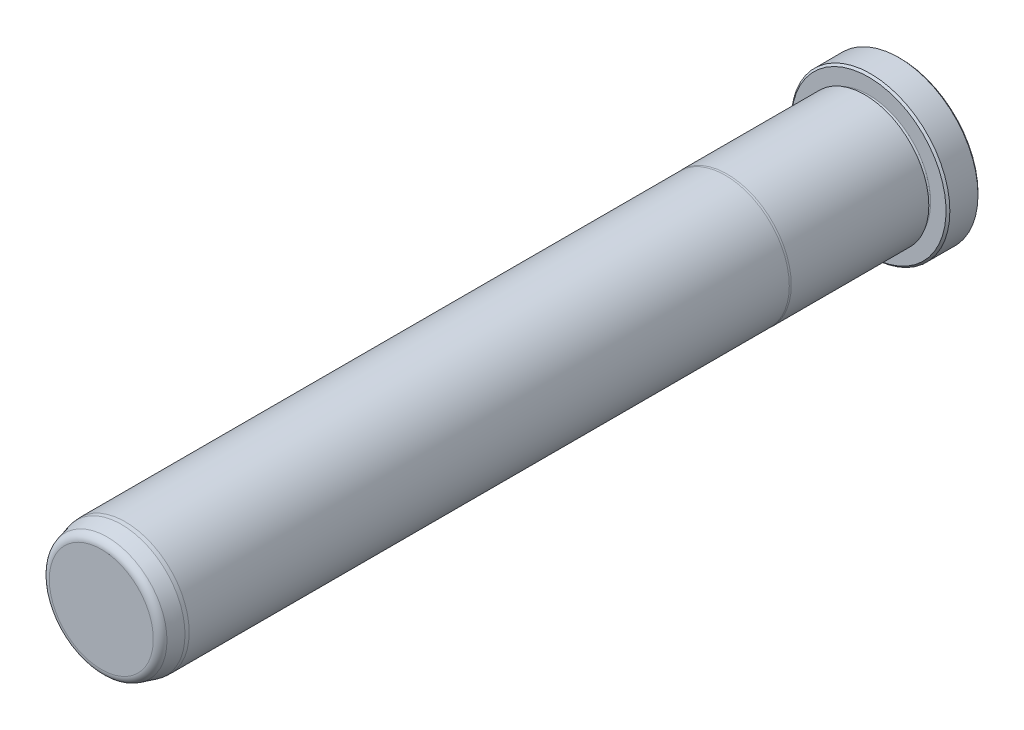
ISO-10303-21;
HEADER;
FILE_DESCRIPTION(('STEP AP214'),'2;1');
FILE_NAME('part.step','',(''),(''),'','','');
FILE_SCHEMA(('AUTOMOTIVE_DESIGN { 1 0 10303 214 1 1 1 1 }'));
ENDSEC;
DATA;
#1=APPLICATION_CONTEXT('core data for automotive mechanical design processes');
#2=APPLICATION_PROTOCOL_DEFINITION('international standard','automotive_design',2000,#1);
#3=PRODUCT_CONTEXT('',#1,'mechanical');
#4=PRODUCT('Part','Part','',(#3));
#5=PRODUCT_RELATED_PRODUCT_CATEGORY('part','',(#4));
#6=PRODUCT_DEFINITION_FORMATION('','',#4);
#7=PRODUCT_DEFINITION_CONTEXT('part definition',#1,'design');
#8=PRODUCT_DEFINITION('design','',#6,#7);
#9=PRODUCT_DEFINITION_SHAPE('','',#8);
#10=(LENGTH_UNIT() NAMED_UNIT(*) SI_UNIT(.MILLI.,.METRE.));
#11=(NAMED_UNIT(*) PLANE_ANGLE_UNIT() SI_UNIT($,.RADIAN.));
#12=(NAMED_UNIT(*) SI_UNIT($,.STERADIAN.) SOLID_ANGLE_UNIT());
#13=UNCERTAINTY_MEASURE_WITH_UNIT(LENGTH_MEASURE(1.E-05),#10,'distance_accuracy_value','');
#14=(GEOMETRIC_REPRESENTATION_CONTEXT(3) GLOBAL_UNCERTAINTY_ASSIGNED_CONTEXT((#13)) GLOBAL_UNIT_ASSIGNED_CONTEXT((#10,
#11,#12)) REPRESENTATION_CONTEXT('',''));
#15=CARTESIAN_POINT('',(0.,0.,0.));
#16=DIRECTION('',(0.,0.,1.));
#17=DIRECTION('',(1.,0.,0.));
#18=AXIS2_PLACEMENT_3D('',#15,#16,#17);
#19=CARTESIAN_POINT('',(0.,0.,0.));
#20=DIRECTION('',(0.,0.,1.));
#21=DIRECTION('',(1.,0.,0.));
#22=AXIS2_PLACEMENT_3D('',#19,#20,#21);
#23=PLANE('',#22);
#24=CARTESIAN_POINT('',(0.,0.,0.));
#25=DIRECTION('',(0.,0.,1.));
#26=DIRECTION('',(1.,0.,0.));
#27=AXIS2_PLACEMENT_3D('',#24,#25,#26);
#28=CIRCLE('',#27,15.367);
#29=CARTESIAN_POINT('',(15.367,0.,0.));
#30=VERTEX_POINT('',#29);
#31=EDGE_CURVE('E37',#30,#30,#28,.F.);
#32=ORIENTED_EDGE('',*,*,#31,.T.);
#33=EDGE_LOOP('',(#32));
#34=FACE_BOUND('',#33,.T.);
#35=ADVANCED_FACE('F30',(#34),#23,.F.);
#36=CARTESIAN_POINT('',(0.,0.,0.));
#37=DIRECTION('',(0.,0.,1.));
#38=DIRECTION('',(1.,0.,0.));
#39=AXIS2_PLACEMENT_3D('',#36,#37,#38);
#40=CYLINDRICAL_SURFACE('',#39,15.748);
#41=CARTESIAN_POINT('',(0.,0.,0.380999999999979));
#42=DIRECTION('',(0.,0.,1.));
#43=DIRECTION('',(1.,0.,0.));
#44=AXIS2_PLACEMENT_3D('',#41,#42,#43);
#45=CIRCLE('',#44,15.748);
#46=CARTESIAN_POINT('',(15.748,0.,0.380999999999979));
#47=VERTEX_POINT('',#46);
#48=EDGE_CURVE('E41',#47,#47,#45,.T.);
#49=ORIENTED_EDGE('',*,*,#48,.T.);
#50=EDGE_LOOP('',(#49));
#51=FACE_BOUND('',#50,.T.);
#52=CARTESIAN_POINT('',(0.,0.,5.96899999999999));
#53=DIRECTION('',(0.,0.,-1.));
#54=DIRECTION('',(-1.,0.,0.));
#55=AXIS2_PLACEMENT_3D('',#52,#53,#54);
#56=CIRCLE('',#55,15.748);
#57=CARTESIAN_POINT('',(-15.748,0.,5.96899999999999));
#58=VERTEX_POINT('',#57);
#59=EDGE_CURVE('E45',#58,#58,#56,.T.);
#60=ORIENTED_EDGE('',*,*,#59,.T.);
#61=EDGE_LOOP('',(#60));
#62=FACE_BOUND('',#61,.T.);
#63=ADVANCED_FACE('F118',(#51,#62),#40,.T.);
#64=CARTESIAN_POINT('',(0.,15.748,6.35));
#65=DIRECTION('',(0.,0.,-1.));
#66=DIRECTION('',(-1.,0.,0.));
#67=AXIS2_PLACEMENT_3D('',#64,#65,#66);
#68=PLANE('',#67);
#69=CARTESIAN_POINT('',(0.,0.,6.35));
#70=DIRECTION('',(0.,0.,-1.));
#71=DIRECTION('',(-1.,0.,0.));
#72=AXIS2_PLACEMENT_3D('',#69,#70,#71);
#73=CIRCLE('',#72,15.367);
#74=CARTESIAN_POINT('',(-15.367,0.,6.35));
#75=VERTEX_POINT('',#74);
#76=EDGE_CURVE('E10',#75,#75,#73,.F.);
#77=ORIENTED_EDGE('',*,*,#76,.T.);
#78=EDGE_LOOP('',(#77));
#79=FACE_BOUND('',#78,.T.);
#80=CARTESIAN_POINT('',(0.,0.,6.35));
#81=DIRECTION('',(0.,0.,1.));
#82=DIRECTION('',(1.,0.,0.));
#83=AXIS2_PLACEMENT_3D('',#80,#81,#82);
#84=CIRCLE('',#83,12.3063);
#85=CARTESIAN_POINT('',(12.3063,0.,6.35));
#86=VERTEX_POINT('',#85);
#87=EDGE_CURVE('E56',#86,#86,#84,.T.);
#88=ORIENTED_EDGE('',*,*,#87,.F.);
#89=EDGE_LOOP('',(#88));
#90=FACE_BOUND('',#89,.T.);
#91=ADVANCED_FACE('F113',(#79,#90),#68,.F.);
#92=CARTESIAN_POINT('',(0.,0.,6.731));
#93=DIRECTION('',(0.,0.,1.));
#94=DIRECTION('',(1.,0.,0.));
#95=AXIS2_PLACEMENT_3D('',#92,#93,#94);
#96=TOROIDAL_SURFACE('',#95,12.3063,0.381);
#97=CARTESIAN_POINT('',(0.,0.,7.112));
#98=DIRECTION('',(0.,0.,1.));
#99=DIRECTION('',(1.,0.,0.));
#100=AXIS2_PLACEMENT_3D('',#97,#98,#99);
#101=CIRCLE('',#100,12.3063);
#102=CARTESIAN_POINT('',(12.3063,0.,7.112));
#103=VERTEX_POINT('',#102);
#104=EDGE_CURVE('E59',#103,#103,#101,.T.);
#105=ORIENTED_EDGE('',*,*,#104,.F.);
#106=EDGE_LOOP('',(#105));
#107=FACE_BOUND('',#106,.T.);
#108=ORIENTED_EDGE('',*,*,#87,.T.);
#109=EDGE_LOOP('',(#108));
#110=FACE_BOUND('',#109,.T.);
#111=ADVANCED_FACE('F107',(#107,#110),#96,.F.);
#112=CARTESIAN_POINT('',(0.,12.3063,7.112));
#113=DIRECTION('',(0.,0.,1.));
#114=DIRECTION('',(1.,0.,0.));
#115=AXIS2_PLACEMENT_3D('',#112,#113,#114);
#116=PLANE('',#115);
#117=CARTESIAN_POINT('',(0.,0.,7.112));
#118=DIRECTION('',(0.,0.,1.));
#119=DIRECTION('',(1.,0.,0.));
#120=AXIS2_PLACEMENT_3D('',#117,#118,#119);
#121=CIRCLE('',#120,12.7127);
#122=CARTESIAN_POINT('',(12.7127,0.,7.112));
#123=VERTEX_POINT('',#122);
#124=EDGE_CURVE('E62',#123,#123,#121,.T.);
#125=ORIENTED_EDGE('',*,*,#124,.F.);
#126=EDGE_LOOP('',(#125));
#127=FACE_BOUND('',#126,.T.);
#128=ORIENTED_EDGE('',*,*,#104,.T.);
#129=EDGE_LOOP('',(#128));
#130=FACE_BOUND('',#129,.T.);
#131=ADVANCED_FACE('F101',(#127,#130),#116,.F.);
#132=CARTESIAN_POINT('',(0.,0.,0.));
#133=DIRECTION('',(0.,0.,1.));
#134=DIRECTION('',(1.,0.,0.));
#135=AXIS2_PLACEMENT_3D('',#132,#133,#134);
#136=CYLINDRICAL_SURFACE('',#135,12.7127);
#137=CARTESIAN_POINT('',(0.,0.,34.4347630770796));
#138=DIRECTION('',(0.,0.,1.));
#139=DIRECTION('',(1.,0.,0.));
#140=AXIS2_PLACEMENT_3D('',#137,#138,#139);
#141=CIRCLE('',#140,12.7127);
#142=CARTESIAN_POINT('',(12.7127,0.,34.4347630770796));
#143=VERTEX_POINT('',#142);
#144=EDGE_CURVE('E65',#143,#143,#141,.T.);
#145=ORIENTED_EDGE('',*,*,#144,.F.);
#146=EDGE_LOOP('',(#145));
#147=FACE_BOUND('',#146,.T.);
#148=ORIENTED_EDGE('',*,*,#124,.T.);
#149=EDGE_LOOP('',(#148));
#150=FACE_BOUND('',#149,.T.);
#151=ADVANCED_FACE('F95',(#147,#150),#136,.T.);
#152=CARTESIAN_POINT('',(0.,0.,34.4347630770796));
#153=DIRECTION('',(0.,0.,-1.));
#154=DIRECTION('',(-1.,0.,0.));
#155=AXIS2_PLACEMENT_3D('',#152,#153,#154);
#156=CONICAL_SURFACE('',#155,12.7127,0.0698131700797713);
#157=CARTESIAN_POINT('',(0.,0.,34.798));
#158=DIRECTION('',(0.,0.,1.));
#159=DIRECTION('',(1.,0.,0.));
#160=AXIS2_PLACEMENT_3D('',#157,#158,#159);
#161=CIRCLE('',#160,12.6873);
#162=CARTESIAN_POINT('',(12.6873,0.,34.798));
#163=VERTEX_POINT('',#162);
#164=EDGE_CURVE('E68',#163,#163,#161,.T.);
#165=ORIENTED_EDGE('',*,*,#164,.F.);
#166=EDGE_LOOP('',(#165));
#167=FACE_BOUND('',#166,.T.);
#168=ORIENTED_EDGE('',*,*,#144,.T.);
#169=EDGE_LOOP('',(#168));
#170=FACE_BOUND('',#169,.T.);
#171=ADVANCED_FACE('F89',(#167,#170),#156,.T.);
#172=CARTESIAN_POINT('',(0.,0.,0.));
#173=DIRECTION('',(0.,0.,1.));
#174=DIRECTION('',(1.,0.,0.));
#175=AXIS2_PLACEMENT_3D('',#172,#173,#174);
#176=CYLINDRICAL_SURFACE('',#175,12.6873);
#177=CARTESIAN_POINT('',(0.,0.,153.9875));
#178=DIRECTION('',(0.,0.,1.));
#179=DIRECTION('',(1.,0.,0.));
#180=AXIS2_PLACEMENT_3D('',#177,#178,#179);
#181=CIRCLE('',#180,12.6873);
#182=CARTESIAN_POINT('',(12.6873,0.,153.9875));
#183=VERTEX_POINT('',#182);
#184=EDGE_CURVE('E71',#183,#183,#181,.T.);
#185=ORIENTED_EDGE('',*,*,#184,.F.);
#186=EDGE_LOOP('',(#185));
#187=FACE_BOUND('',#186,.T.);
#188=ORIENTED_EDGE('',*,*,#164,.T.);
#189=EDGE_LOOP('',(#188));
#190=FACE_BOUND('',#189,.T.);
#191=ADVANCED_FACE('F83',(#187,#190),#176,.T.);
#192=CARTESIAN_POINT('',(0.,0.,153.9875));
#193=DIRECTION('',(0.,0.,-1.));
#194=DIRECTION('',(-1.,0.,0.));
#195=AXIS2_PLACEMENT_3D('',#192,#193,#194);
#196=CONICAL_SURFACE('',#195,12.6873,0.0872664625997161);
#197=CARTESIAN_POINT('',(0.,0.,154.7495));
#198=DIRECTION('',(0.,0.,1.));
#199=DIRECTION('',(1.,0.,0.));
#200=AXIS2_PLACEMENT_3D('',#197,#198,#199);
#201=CIRCLE('',#200,12.6206336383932);
#202=CARTESIAN_POINT('',(12.6206336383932,0.,154.7495));
#203=VERTEX_POINT('',#202);
#204=EDGE_CURVE('E74',#203,#203,#201,.T.);
#205=ORIENTED_EDGE('',*,*,#204,.F.);
#206=EDGE_LOOP('',(#205));
#207=FACE_BOUND('',#206,.T.);
#208=ORIENTED_EDGE('',*,*,#184,.T.);
#209=EDGE_LOOP('',(#208));
#210=FACE_BOUND('',#209,.T.);
#211=ADVANCED_FACE('F80',(#207,#210),#196,.T.);
#212=CARTESIAN_POINT('',(0.,0.,154.7495));
#213=DIRECTION('',(0.,0.,-1.));
#214=DIRECTION('',(-1.,0.,0.));
#215=AXIS2_PLACEMENT_3D('',#212,#213,#214);
#216=CONICAL_SURFACE('',#215,12.6206336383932,0.26179938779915);
#217=CARTESIAN_POINT('',(0.,0.,157.5733752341));
#218=DIRECTION('',(0.,0.,1.));
#219=DIRECTION('',(1.,0.,0.));
#220=AXIS2_PLACEMENT_3D('',#217,#218,#219);
#221=CIRCLE('',#220,11.8639785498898);
#222=CARTESIAN_POINT('',(11.8639785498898,0.,157.5733752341));
#223=VERTEX_POINT('',#222);
#224=EDGE_CURVE('E50',#223,#223,#221,.F.);
#225=ORIENTED_EDGE('',*,*,#224,.T.);
#226=EDGE_LOOP('',(#225));
#227=FACE_BOUND('',#226,.T.);
#228=ORIENTED_EDGE('',*,*,#204,.T.);
#229=EDGE_LOOP('',(#228));
#230=FACE_BOUND('',#229,.T.);
#231=ADVANCED_FACE('F78',(#227,#230),#216,.T.);
#232=CARTESIAN_POINT('',(0.,11.5487028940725,158.75));
#233=DIRECTION('',(0.,0.,-1.));
#234=DIRECTION('',(-1.,0.,0.));
#235=AXIS2_PLACEMENT_3D('',#232,#233,#234);
#236=PLANE('',#235);
#237=CARTESIAN_POINT('',(0.,0.,158.75));
#238=DIRECTION('',(0.,0.,-1.));
#239=DIRECTION('',(-1.,0.,0.));
#240=AXIS2_PLACEMENT_3D('',#237,#238,#239);
#241=CIRCLE('',#240,10.3305713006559);
#242=CARTESIAN_POINT('',(-10.3305713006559,0.,158.75));
#243=VERTEX_POINT('',#242);
#244=EDGE_CURVE('E53',#243,#243,#241,.F.);
#245=ORIENTED_EDGE('',*,*,#244,.T.);
#246=EDGE_LOOP('',(#245));
#247=FACE_BOUND('',#246,.T.);
#248=ADVANCED_FACE('F133',(#247),#236,.F.);
#249=CARTESIAN_POINT('',(0.,0.,157.1625));
#250=DIRECTION('',(0.,0.,-1.));
#251=DIRECTION('',(-1.,0.,0.));
#252=AXIS2_PLACEMENT_3D('',#249,#250,#251);
#253=TOROIDAL_SURFACE('',#252,10.3305713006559,1.5875);
#254=ORIENTED_EDGE('',*,*,#224,.F.);
#255=EDGE_LOOP('',(#254));
#256=FACE_BOUND('',#255,.T.);
#257=ORIENTED_EDGE('',*,*,#244,.F.);
#258=EDGE_LOOP('',(#257));
#259=FACE_BOUND('',#258,.T.);
#260=ADVANCED_FACE('F130',(#256,#259),#253,.T.);
#261=CARTESIAN_POINT('',(0.,0.,0.380999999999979));
#262=DIRECTION('',(0.,0.,1.));
#263=DIRECTION('',(1.,0.,0.));
#264=AXIS2_PLACEMENT_3D('',#261,#262,#263);
#265=CONICAL_SURFACE('',#264,15.748,0.785398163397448);
#266=ORIENTED_EDGE('',*,*,#31,.F.);
#267=EDGE_LOOP('',(#266));
#268=FACE_BOUND('',#267,.T.);
#269=ORIENTED_EDGE('',*,*,#48,.F.);
#270=EDGE_LOOP('',(#269));
#271=FACE_BOUND('',#270,.T.);
#272=ADVANCED_FACE('F132',(#268,#271),#265,.T.);
#273=CARTESIAN_POINT('',(0.,0.,6.35));
#274=DIRECTION('',(0.,0.,-1.));
#275=DIRECTION('',(-1.,0.,0.));
#276=AXIS2_PLACEMENT_3D('',#273,#274,#275);
#277=CONICAL_SURFACE('',#276,15.367,0.785398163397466);
#278=CARTESIAN_POINT('',(-15.748,0.,5.96899999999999));
#279=CARTESIAN_POINT('',(-15.74403125,0.,5.97296874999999));
#280=CARTESIAN_POINT('',(-15.7400625,0.,5.97693749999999));
#281=CARTESIAN_POINT('',(-15.732125,0.,5.98487499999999));
#282=CARTESIAN_POINT('',(-15.72815625,0.,5.98884374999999));
#283=CARTESIAN_POINT('',(-15.72021875,0.,5.99678125));
#284=CARTESIAN_POINT('',(-15.71625,0.,6.00074999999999));
#285=CARTESIAN_POINT('',(-15.7083125,0.,6.00868749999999));
#286=CARTESIAN_POINT('',(-15.70434375,0.,6.01265625));
#287=CARTESIAN_POINT('',(-15.69640625,0.,6.02059375));
#288=CARTESIAN_POINT('',(-15.6924375,0.,6.02456249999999));
#289=CARTESIAN_POINT('',(-15.6845,0.,6.03249999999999));
#290=CARTESIAN_POINT('',(-15.68053125,0.,6.03646875));
#291=CARTESIAN_POINT('',(-15.67259375,0.,6.04440625));
#292=CARTESIAN_POINT('',(-15.668625,0.,6.04837499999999));
#293=CARTESIAN_POINT('',(-15.6606875,0.,6.05631249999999));
#294=CARTESIAN_POINT('',(-15.65671875,0.,6.06028125));
#295=CARTESIAN_POINT('',(-15.64878125,0.,6.06821875));
#296=CARTESIAN_POINT('',(-15.6448125,0.,6.07218749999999));
#297=CARTESIAN_POINT('',(-15.636875,0.,6.080125));
#298=CARTESIAN_POINT('',(-15.63290625,0.,6.08409375));
#299=CARTESIAN_POINT('',(-15.62496875,0.,6.09203125));
#300=CARTESIAN_POINT('',(-15.621,0.,6.096));
#301=CARTESIAN_POINT('',(-15.6130625,0.,6.1039375));
#302=CARTESIAN_POINT('',(-15.60909375,0.,6.10790625));
#303=CARTESIAN_POINT('',(-15.60115625,0.,6.11584375));
#304=CARTESIAN_POINT('',(-15.5971875,0.,6.1198125));
#305=CARTESIAN_POINT('',(-15.58925,0.,6.12775));
#306=CARTESIAN_POINT('',(-15.58528125,0.,6.13171875));
#307=CARTESIAN_POINT('',(-15.57734375,0.,6.13965625));
#308=CARTESIAN_POINT('',(-15.573375,0.,6.143625));
#309=CARTESIAN_POINT('',(-15.5654375,0.,6.1515625));
#310=CARTESIAN_POINT('',(-15.56146875,0.,6.15553125));
#311=CARTESIAN_POINT('',(-15.55353125,0.,6.16346875));
#312=CARTESIAN_POINT('',(-15.5495625,0.,6.1674375));
#313=CARTESIAN_POINT('',(-15.541625,0.,6.175375));
#314=CARTESIAN_POINT('',(-15.53765625,0.,6.17934375));
#315=CARTESIAN_POINT('',(-15.52971875,0.,6.18728125));
#316=CARTESIAN_POINT('',(-15.52575,0.,6.19125));
#317=CARTESIAN_POINT('',(-15.5178125,0.,6.1991875));
#318=CARTESIAN_POINT('',(-15.51384375,0.,6.20315625));
#319=CARTESIAN_POINT('',(-15.50590625,0.,6.21109375));
#320=CARTESIAN_POINT('',(-15.5019375,0.,6.2150625));
#321=CARTESIAN_POINT('',(-15.494,0.,6.223));
#322=CARTESIAN_POINT('',(-15.49003125,0.,6.22696875));
#323=CARTESIAN_POINT('',(-15.48209375,0.,6.23490625));
#324=CARTESIAN_POINT('',(-15.478125,0.,6.238875));
#325=CARTESIAN_POINT('',(-15.4701875,0.,6.2468125));
#326=CARTESIAN_POINT('',(-15.46621875,0.,6.25078125));
#327=CARTESIAN_POINT('',(-15.45828125,0.,6.25871875));
#328=CARTESIAN_POINT('',(-15.4543125,0.,6.2626875));
#329=CARTESIAN_POINT('',(-15.446375,0.,6.270625));
#330=CARTESIAN_POINT('',(-15.44240625,0.,6.27459375));
#331=CARTESIAN_POINT('',(-15.43446875,0.,6.28253125));
#332=CARTESIAN_POINT('',(-15.4305,0.,6.2865));
#333=CARTESIAN_POINT('',(-15.4225625,0.,6.2944375));
#334=CARTESIAN_POINT('',(-15.41859375,0.,6.29840625));
#335=CARTESIAN_POINT('',(-15.41065625,0.,6.30634375));
#336=CARTESIAN_POINT('',(-15.4066875,0.,6.3103125));
#337=CARTESIAN_POINT('',(-15.39875,0.,6.31825));
#338=CARTESIAN_POINT('',(-15.39478125,0.,6.32221875));
#339=CARTESIAN_POINT('',(-15.38684375,0.,6.33015625));
#340=CARTESIAN_POINT('',(-15.382875,0.,6.334125));
#341=CARTESIAN_POINT('',(-15.3749375,0.,6.3420625));
#342=CARTESIAN_POINT('',(-15.37096875,0.,6.34603125));
#343=CARTESIAN_POINT('',(-15.367,0.,6.35));
#344=B_SPLINE_CURVE_WITH_KNOTS('',3,(#278,#279,#280,#281,#282,#283,#284,#285,#286,#287,#288,
#289,#290,#291,#292,#293,#294,#295,#296,#297,#298,#299,#300,#301,#302,#303,#304,#305,#306,#307,
#308,#309,#310,#311,#312,#313,#314,#315,#316,#317,#318,#319,#320,#321,#322,#323,#324,#325,#326,
#327,#328,#329,#330,#331,#332,#333,#334,#335,#336,#337,#338,#339,#340,#341,#342,#343),
.UNSPECIFIED.,.F.,.F.,(4,2,2,2,2,2,2,2,2,2,2,2,2,2,2,2,2,2,2,2,2,2,2,2,2,2,2,2,2,2,2,2,4),(0.,
0.0168379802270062,0.0336759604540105,0.0505139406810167,0.067351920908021,0.0841899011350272,
0.101027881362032,0.117865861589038,0.134703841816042,0.151541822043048,0.168379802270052,
0.185217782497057,0.202055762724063,0.218893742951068,0.235731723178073,0.252569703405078,
0.269407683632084,0.286245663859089,0.303083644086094,0.319921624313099,0.336759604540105,
0.35359758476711,0.370435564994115,0.38727354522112,0.404111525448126,0.420949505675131,
0.437787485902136,0.454625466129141,0.471463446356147,0.488301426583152,0.505139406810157,
0.521977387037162,0.538815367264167),.UNSPECIFIED.);
#345=EDGE_CURVE('BSEAM32',#58,#75,#344,.T.);
#346=ORIENTED_EDGE('',*,*,#59,.F.);
#347=ORIENTED_EDGE('',*,*,#76,.F.);
#348=ORIENTED_EDGE('',*,*,#345,.T.);
#349=ORIENTED_EDGE('',*,*,#345,.F.);
#350=EDGE_LOOP('',(#346,#348,#347,#349));
#351=FACE_BOUND('',#350,.T.);
#352=ADVANCED_FACE('F32',(#351),#277,.T.);
#353=CLOSED_SHELL('',(#35,#63,#91,#111,#131,#151,#171,#191,#211,#231,#248,#260,#272,#352));
#354=MANIFOLD_SOLID_BREP('B2',#353);
#355=ADVANCED_BREP_SHAPE_REPRESENTATION('',(#18,#354),#14);
#356=SHAPE_DEFINITION_REPRESENTATION(#9,#355);
ENDSEC;
END-ISO-10303-21;
